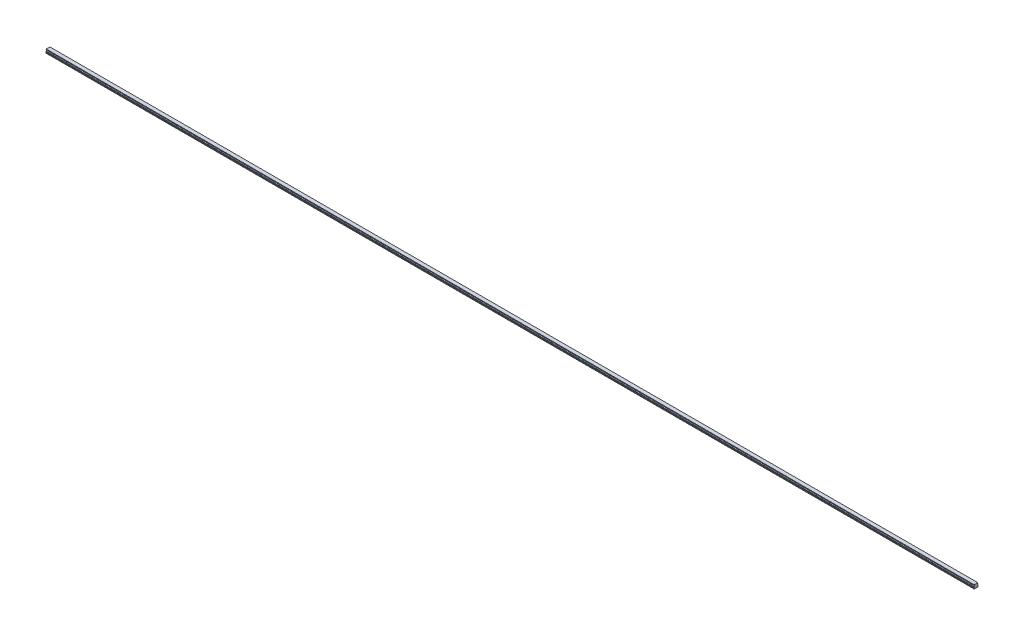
from build123d import *

# Parameters (mm, degrees)
BOSS_EXTRUDE1_DEPTH        = 3360
SKETCH3_R                  = 2.5
SKETCH3_R_2                = 2.1
CUT_EXTRUDE3_DEPTH         = 7
SKETCH3_2_R                = 2.1
CUT_EXTRUDE4_DEPTH         = 9.5
CHAMFER1_SIZE              = 0.4
LPATTERN2_COUNT            = 56
LPATTERN2_PITCH            = 60
CHAMFER1_OF_LPATTERN2_SIZE = 0.4


with BuildPart() as part:
    # Sketch1 → Boss-Extrude1 (new body)
    with BuildSketch(Plane(origin=(0, 0, 0), x_dir=(0, 0, -1), z_dir=(1, 0, 0))):
        with BuildLine():
            Line((6.59, 14), (-6.59, 14))
            Line((-6.59, 14), (-6.59, 13.15))
            Line((-6.59, 13.15), (-6.96, 12.356532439))
            Line((-6.96, 12.356532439), (-6.96, 11.435174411))
            ThreePointArc((-6.96, 11.435174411), (-5.25, 9.5), (-6.96, 7.564825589))
            Line((-6.96, 7.564825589), (-6.96, 6.643467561))
            Line((-6.96, 6.643467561), (-6.59, 5.85))
            Line((-6.59, 5.85), (-7.032116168, 4.2))
            Line((-7.032116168, 4.2), (-7.5, 3.929867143))
            Line((-7.5, 3.929867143), (-7.5, 1.4))
            Line((-7.5, 1.4), (-6.1, 0))
            Line((-6.1, 0), (-3.65, 0))
            Line((-3.65, 0), (-3.25, 0.4))
            Line((-3.25, 0.4), (3.25, 0.4))
            Line((3.25, 0.4), (3.65, 0))
            Line((3.65, 0), (6.1, 0))
            Line((6.1, 0), (7.5, 1.4))
            Line((7.5, 1.4), (7.5, 3.929867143))
            Line((7.5, 3.929867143), (7.032116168, 4.2))
            Line((7.032116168, 4.2), (6.59, 5.85))
            Line((6.59, 5.85), (6.96, 6.643467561))
            Line((6.96, 6.643467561), (6.96, 7.564825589))
            ThreePointArc((6.96, 7.564825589), (5.25, 9.5), (6.96, 11.435174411))
            Line((6.96, 11.435174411), (6.96, 12.356532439))
            Line((6.96, 12.356532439), (6.59, 13.15))
            Line((6.59, 13.15), (6.59, 14))
        make_face()
    extrude(amount=BOSS_EXTRUDE1_DEPTH)

    # Sketch3 → Cut-Extrude3 (cut)
    with BuildSketch(Plane.XZ):
        with Locations(Location((30, 0, 0), (0, 0, 270))):
            Circle(SKETCH3_R)
        with Locations(Location((30, 0, 0), (0, 0, 270))):
            Circle(SKETCH3_R_2, mode=Mode.SUBTRACT)
    cut_extrude3 = extrude(amount=-CUT_EXTRUDE3_DEPTH, mode=Mode.SUBTRACT)

    # Sketch3_2 → Cut-Extrude4 (cut)
    with BuildSketch(Plane.XZ):
        with Locations(Location((30, 0, 0), (0, 0, 270))):
            Circle(SKETCH3_2_R)
    cut_extrude4 = extrude(amount=-CUT_EXTRUDE4_DEPTH, mode=Mode.SUBTRACT)

    # Cut-Extrude5 cone 1 section (on through the dimple's axis) → Cut-Extrude5 (revolve, cut)
    with BuildSketch(Plane(origin=(30, 9.5, 0), x_dir=(0, 0, -1), z_dir=(1, 0, 0))):
        Polygon((0, 0), (2.1, 0), (0, 1.212435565), align=None)
    revolve(axis=Axis((30, 9.5, 0), (0, 1, 0)), mode=Mode.SUBTRACT)

    # Chamfer1
    chamfer1_edges = [part.edges().sort_by_distance(p)[0] for p in [
        (30, 0.4, 2.5),
    ]]
    chamfer(chamfer1_edges, length=CHAMFER1_SIZE)

    # LPattern2: Cut-Extrude3, Cut-Extrude4 ×56
    with Locations(*[(i * LPATTERN2_PITCH, 0, 0) for i in range(1, LPATTERN2_COUNT)]):
        add(cut_extrude3, mode=Mode.SUBTRACT)
        add(cut_extrude4, mode=Mode.SUBTRACT)

    # Chamfer1 of LPattern2
    chamfer1_of_lpattern2_edges = [part.edges().sort_by_distance(p)[0] for p in [
        (90, 0.4, 2.5),
        (150, 0.4, 2.5),
        (210, 0.4, 2.5),
        (270, 0.4, 2.5),
        (330, 0.4, 2.5),
        (390, 0.4, 2.5),
        (450, 0.4, 2.5),
        (510, 0.4, 2.5),
        (570, 0.4, 2.5),
        (630, 0.4, 2.5),
        (690, 0.4, 2.5),
        (750, 0.4, 2.5),
        (810, 0.4, 2.5),
        (870, 0.4, 2.5),
        (930, 0.4, 2.5),
        (990, 0.4, 2.5),
        (1050, 0.4, 2.5),
        (1110, 0.4, 2.5),
        (1170, 0.4, 2.5),
        (1230, 0.4, 2.5),
        (1290, 0.4, 2.5),
        (1350, 0.4, 2.5),
        (1410, 0.4, 2.5),
        (1470, 0.4, 2.5),
        (1530, 0.4, 2.5),
        (1590, 0.4, 2.5),
        (1650, 0.4, 2.5),
        (1710, 0.4, 2.5),
        (1770, 0.4, 2.5),
        (1830, 0.4, 2.5),
        (1890, 0.4, 2.5),
        (1950, 0.4, 2.5),
        (2010, 0.4, 2.5),
        (2070, 0.4, 2.5),
        (2130, 0.4, 2.5),
        (2190, 0.4, 2.5),
        (2250, 0.4, 2.5),
        (2310, 0.4, 2.5),
        (2370, 0.4, 2.5),
        (2430, 0.4, 2.5),
        (2490, 0.4, 2.5),
        (2550, 0.4, 2.5),
        (2610, 0.4, 2.5),
        (2670, 0.4, 2.5),
        (2730, 0.4, 2.5),
        (2790, 0.4, 2.5),
        (2850, 0.4, 2.5),
        (2910, 0.4, 2.5),
        (2970, 0.4, 2.5),
        (3030, 0.4, 2.5),
        (3090, 0.4, 2.5),
        (3150, 0.4, 2.5),
        (3210, 0.4, 2.5),
        (3270, 0.4, 2.5),
        (3330, 0.4, 2.5),
    ]]
    chamfer(chamfer1_of_lpattern2_edges, length=CHAMFER1_OF_LPATTERN2_SIZE)


solid = part.part
